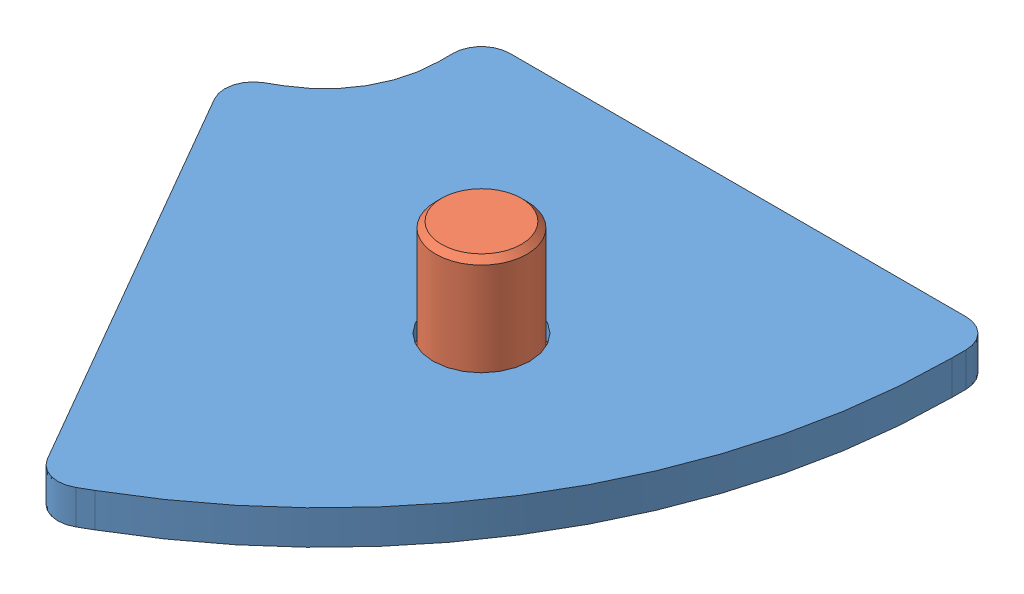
SolidWorks assembly 22.1018_2 END CAP 45 R 60 DEG ALU.SLDASM, configuration Default (file format 6000). Lengths in mm.
Overall size (52.32 11.5 52.32).
2 component instances, 2 part files, 2 mates.
Components (placement in the parent):
- 22.1018_2 end cap 45 r 60 deg alu-1: 22.1018_2 end cap 45 r 60 deg alu.SLDPRT [Default] at origin size (52.32 3 52.32)
- 21.1666 M8x10 Stainless-1: 21.1666 M8x10 Stainless.SLDPRT [Default] at (22.5 -3 22.5) x (0.000364 0 1) z (0 -1 0) size (12 12 11.5)
Mates (geometry in assembly coordinates):
- Concentric1: concentric anti-aligned: cylinder of 22.1018_2 end cap 45 r 60 deg alu-1 through (22.5 -1.5 22.5) axis (0 -1 0) radius 4.25; cylinder of 21.1666 M8x10 Stainless-1 through (22.5 -3 22.5) axis (0 1 0) radius 6
- Coincident1: coincident anti-aligned: plane of 22.1018_2 end cap 45 r 60 deg alu-1 through (22.5 -1.5 22.5) normal (0 -1 0); plane of 21.1666 M8x10 Stainless-1 through (22.5 -1.5 22.5) normal (0 1 0)
